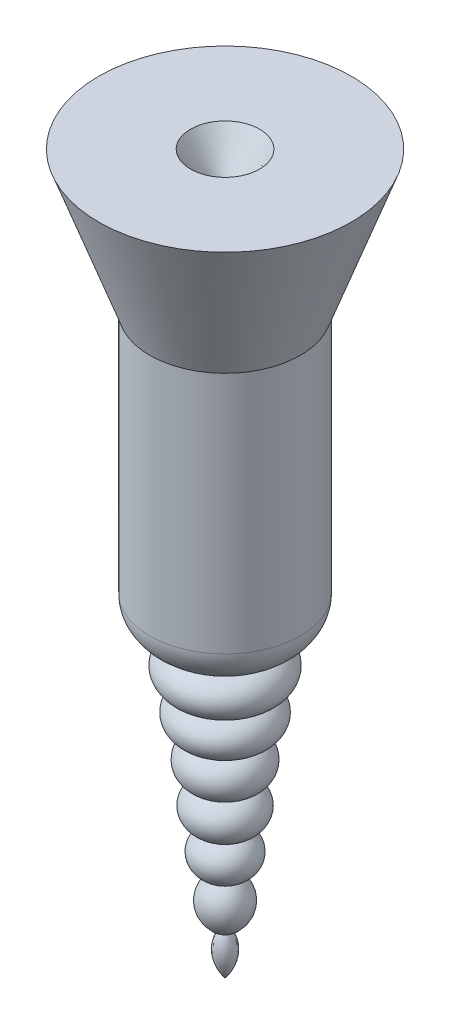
ISO-10303-21;
HEADER;
FILE_DESCRIPTION(('STEP AP214'),'2;1');
FILE_NAME('part.step','',(''),(''),'','','');
FILE_SCHEMA(('AUTOMOTIVE_DESIGN { 1 0 10303 214 1 1 1 1 }'));
ENDSEC;
DATA;
#1=APPLICATION_CONTEXT('core data for automotive mechanical design processes');
#2=APPLICATION_PROTOCOL_DEFINITION('international standard','automotive_design',2000,#1);
#3=PRODUCT_CONTEXT('',#1,'mechanical');
#4=PRODUCT('Part','Part','',(#3));
#5=PRODUCT_RELATED_PRODUCT_CATEGORY('part','',(#4));
#6=PRODUCT_DEFINITION_FORMATION('','',#4);
#7=PRODUCT_DEFINITION_CONTEXT('part definition',#1,'design');
#8=PRODUCT_DEFINITION('design','',#6,#7);
#9=PRODUCT_DEFINITION_SHAPE('','',#8);
#10=(LENGTH_UNIT() NAMED_UNIT(*) SI_UNIT(.MILLI.,.METRE.));
#11=(NAMED_UNIT(*) PLANE_ANGLE_UNIT() SI_UNIT($,.RADIAN.));
#12=(NAMED_UNIT(*) SI_UNIT($,.STERADIAN.) SOLID_ANGLE_UNIT());
#13=UNCERTAINTY_MEASURE_WITH_UNIT(LENGTH_MEASURE(1.E-05),#10,'distance_accuracy_value','');
#14=(GEOMETRIC_REPRESENTATION_CONTEXT(3) GLOBAL_UNCERTAINTY_ASSIGNED_CONTEXT((#13)) GLOBAL_UNIT_ASSIGNED_CONTEXT((#10,
#11,#12)) REPRESENTATION_CONTEXT('',''));
#15=CARTESIAN_POINT('',(0.,0.,0.));
#16=DIRECTION('',(0.,0.,1.));
#17=DIRECTION('',(1.,0.,0.));
#18=AXIS2_PLACEMENT_3D('',#15,#16,#17);
#19=CARTESIAN_POINT('',(0.387200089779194,-5.90390209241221,0.));
#20=DIRECTION('',(0.,0.,1.));
#21=DIRECTION('',(0.99999813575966,0.00193092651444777,0.));
#22=AXIS2_PLACEMENT_3D('',#19,#20,#21);
#23=ELLIPSE('',#22,0.944896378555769,0.756009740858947);
#24=TRIMMED_CURVE('',#23,(PARAMETER_VALUE(4.28863035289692)),
(PARAMETER_VALUE(8.27465039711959)),.T.,.PARAMETER.);
#25=CARTESIAN_POINT('',(0.,0.,0.));
#26=DIRECTION('',(0.,1.,0.));
#27=AXIS1_PLACEMENT('',#25,#26);
#28=SURFACE_OF_REVOLUTION('',#24,#27);
#29=CARTESIAN_POINT('',(0.,-5.90324555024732,0.));
#30=DIRECTION('',(0.,1.,0.));
#31=DIRECTION('',(-1.,0.,0.));
#32=AXIS2_PLACEMENT_3D('',#29,#30,#31);
#33=CIRCLE('',#32,1.33209583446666);
#34=CARTESIAN_POINT('',(-1.33209583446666,-5.90324555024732,0.));
#35=VERTEX_POINT('',#34);
#36=EDGE_CURVE('E11',#35,#35,#33,.T.);
#37=ORIENTED_EDGE('',*,*,#36,.F.);
#38=EDGE_LOOP('',(#37));
#39=FACE_BOUND('',#38,.T.);
#40=CARTESIAN_POINT('',(0.,-6.64767513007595,0.));
#41=DIRECTION('',(0.,1.,0.));
#42=DIRECTION('',(-1.,0.,0.));
#43=AXIS2_PLACEMENT_3D('',#40,#41,#42);
#44=CIRCLE('',#43,0.555715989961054);
#45=CARTESIAN_POINT('',(-0.555715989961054,-6.64767513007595,0.));
#46=VERTEX_POINT('',#45);
#47=EDGE_CURVE('E80',#46,#46,#44,.T.);
#48=ORIENTED_EDGE('',*,*,#47,.T.);
#49=EDGE_LOOP('',(#48));
#50=FACE_BOUND('',#49,.T.);
#51=ADVANCED_FACE('F33',(#39,#50),#28,.T.);
#52=CARTESIAN_POINT('',(0.,0.,0.));
#53=DIRECTION('',(0.,1.,0.));
#54=DIRECTION('',(-1.,0.,0.));
#55=AXIS2_PLACEMENT_3D('',#52,#53,#54);
#56=CYLINDRICAL_SURFACE('',#55,1.33209583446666);
#57=CARTESIAN_POINT('',(0.,-1.60252965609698,0.));
#58=DIRECTION('',(0.,1.,0.));
#59=DIRECTION('',(-1.,0.,0.));
#60=AXIS2_PLACEMENT_3D('',#57,#58,#59);
#61=CIRCLE('',#60,1.33209583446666);
#62=CARTESIAN_POINT('',(-1.33209583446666,-1.60252965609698,0.));
#63=VERTEX_POINT('',#62);
#64=EDGE_CURVE('E41',#63,#63,#61,.T.);
#65=ORIENTED_EDGE('',*,*,#64,.F.);
#66=EDGE_LOOP('',(#65));
#67=FACE_BOUND('',#66,.T.);
#68=ORIENTED_EDGE('',*,*,#36,.T.);
#69=EDGE_LOOP('',(#68));
#70=FACE_BOUND('',#69,.T.);
#71=ADVANCED_FACE('F71',(#67,#70),#56,.T.);
#72=CARTESIAN_POINT('',(0.,-1.60252965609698,0.));
#73=DIRECTION('',(0.,1.,0.));
#74=DIRECTION('',(-1.,0.,0.));
#75=AXIS2_PLACEMENT_3D('',#72,#73,#74);
#76=CONICAL_SURFACE('',#75,1.33209583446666,0.347530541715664);
#77=CARTESIAN_POINT('',(0.,0.890631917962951,0.));
#78=DIRECTION('',(0.,1.,0.));
#79=DIRECTION('',(-1.,0.,0.));
#80=AXIS2_PLACEMENT_3D('',#77,#78,#79);
#81=CIRCLE('',#80,2.2352);
#82=CARTESIAN_POINT('',(-2.2352,0.890631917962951,0.));
#83=VERTEX_POINT('',#82);
#84=EDGE_CURVE('E57',#83,#83,#81,.T.);
#85=ORIENTED_EDGE('',*,*,#84,.F.);
#86=EDGE_LOOP('',(#85));
#87=FACE_BOUND('',#86,.T.);
#88=ORIENTED_EDGE('',*,*,#64,.T.);
#89=EDGE_LOOP('',(#88));
#90=FACE_BOUND('',#89,.T.);
#91=ADVANCED_FACE('F69',(#87,#90),#76,.T.);
#92=CARTESIAN_POINT('',(0.611730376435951,0.890631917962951,0.));
#93=DIRECTION('',(0.,-1.,0.));
#94=DIRECTION('',(1.,0.,0.));
#95=AXIS2_PLACEMENT_3D('',#92,#93,#94);
#96=PLANE('',#95);
#97=CARTESIAN_POINT('',(0.,0.890631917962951,0.));
#98=DIRECTION('',(0.,1.,0.));
#99=DIRECTION('',(-1.,0.,0.));
#100=AXIS2_PLACEMENT_3D('',#97,#98,#99);
#101=CIRCLE('',#100,0.611730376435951);
#102=CARTESIAN_POINT('',(-0.611730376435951,0.890631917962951,0.));
#103=VERTEX_POINT('',#102);
#104=EDGE_CURVE('E55',#103,#103,#101,.T.);
#105=ORIENTED_EDGE('',*,*,#104,.F.);
#106=EDGE_LOOP('',(#105));
#107=FACE_BOUND('',#106,.T.);
#108=ORIENTED_EDGE('',*,*,#84,.T.);
#109=EDGE_LOOP('',(#108));
#110=FACE_BOUND('',#109,.T.);
#111=ADVANCED_FACE('F51',(#107,#110),#96,.F.);
#112=CARTESIAN_POINT('',(0.,0.890631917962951,0.));
#113=DIRECTION('',(0.,1.,0.));
#114=DIRECTION('',(-1.,0.,0.));
#115=AXIS2_PLACEMENT_3D('',#112,#113,#114);
#116=CONICAL_SURFACE('',#115,0.611730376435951,0.601845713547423);
#117=CARTESIAN_POINT('',(0.,0.,0.));
#118=VERTEX_POINT('',#117);
#119=VERTEX_LOOP('',#118);
#120=FACE_BOUND('',#119,.T.);
#121=ORIENTED_EDGE('',*,*,#104,.T.);
#122=EDGE_LOOP('',(#121));
#123=FACE_BOUND('',#122,.T.);
#124=ADVANCED_FACE('F47',(#120,#123),#116,.F.);
#125=CARTESIAN_POINT('',(-2.03948248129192,-11.4936827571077,0.));
#126=DIRECTION('',(0.,0.,1.));
#127=DIRECTION('',(0.997056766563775,0.0766668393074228,0.));
#128=AXIS2_PLACEMENT_3D('',#125,#126,#127);
#129=ELLIPSE('',#128,2.21584956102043,1.11741103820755);
#130=TRIMMED_CURVE('',#129,(PARAMETER_VALUE(5.84796007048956)),
(PARAMETER_VALUE(6.640897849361)),.T.,.PARAMETER.);
#131=CARTESIAN_POINT('',(0.,0.,0.));
#132=DIRECTION('',(0.,1.,0.));
#133=AXIS1_PLACEMENT('',#131,#132);
#134=SURFACE_OF_REVOLUTION('',#130,#133);
#135=CARTESIAN_POINT('',(0.,-11.0787103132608,0.));
#136=DIRECTION('',(0.,1.,0.));
#137=DIRECTION('',(-1.,0.,0.));
#138=AXIS2_PLACEMENT_3D('',#135,#136,#137);
#139=CIRCLE('',#138,0.0946009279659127);
#140=CARTESIAN_POINT('',(-0.094600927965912,-11.0787103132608,0.));
#141=VERTEX_POINT('',#140);
#142=EDGE_CURVE('E58',#141,#141,#139,.T.);
#143=ORIENTED_EDGE('',*,*,#142,.F.);
#144=EDGE_LOOP('',(#143));
#145=FACE_BOUND('',#144,.T.);
#146=CARTESIAN_POINT('',(0.,-11.809368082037,0.));
#147=VERTEX_POINT('',#146);
#148=VERTEX_LOOP('',#147);
#149=FACE_BOUND('',#148,.T.);
#150=ADVANCED_FACE('F50',(#145,#149),#134,.T.);
#151=CARTESIAN_POINT('',(-0.296065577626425,-10.6194950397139,0.));
#152=DIRECTION('',(0.,0.,1.));
#153=DIRECTION('',(0.999999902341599,-0.000441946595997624,0.));
#154=AXIS2_PLACEMENT_3D('',#151,#152,#153);
#155=ELLIPSE('',#154,0.692217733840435,0.556198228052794);
#156=TRIMMED_CURVE('',#155,(PARAMETER_VALUE(5.15469734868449)),
(PARAMETER_VALUE(7.412383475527)),.T.,.PARAMETER.);
#157=CARTESIAN_POINT('',(0.,0.,0.));
#158=DIRECTION('',(0.,1.,0.));
#159=AXIS1_PLACEMENT('',#157,#158);
#160=SURFACE_OF_REVOLUTION('',#156,#159);
#161=CARTESIAN_POINT('',(0.,-10.2336673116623,0.));
#162=DIRECTION('',(0.,1.,0.));
#163=DIRECTION('',(-1.,0.,0.));
#164=AXIS2_PLACEMENT_3D('',#161,#162,#163);
#165=CIRCLE('',#164,0.20242874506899);
#166=CARTESIAN_POINT('',(-0.20242874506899,-10.2336673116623,0.));
#167=VERTEX_POINT('',#166);
#168=EDGE_CURVE('E63',#167,#167,#165,.T.);
#169=ORIENTED_EDGE('',*,*,#168,.F.);
#170=EDGE_LOOP('',(#169));
#171=FACE_BOUND('',#170,.T.);
#172=ORIENTED_EDGE('',*,*,#142,.T.);
#173=EDGE_LOOP('',(#172));
#174=FACE_BOUND('',#173,.T.);
#175=ADVANCED_FACE('F103',(#171,#174),#160,.T.);
#176=CARTESIAN_POINT('',(0.023317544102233,-9.8712656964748,0.));
#177=DIRECTION('',(0.,0.,1.));
#178=DIRECTION('',(-0.999999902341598,0.000441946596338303,0.));
#179=AXIS2_PLACEMENT_3D('',#176,#177,#178);
#180=ELLIPSE('',#179,0.478569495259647,0.390775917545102);
#181=TRIMMED_CURVE('',#180,(PARAMETER_VALUE(1.52241447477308)),
(PARAMETER_VALUE(4.76149257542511)),.T.,.PARAMETER.);
#182=CARTESIAN_POINT('',(0.,0.,0.));
#183=DIRECTION('',(0.,1.,0.));
#184=AXIS1_PLACEMENT('',#182,#183);
#185=SURFACE_OF_REVOLUTION('',#181,#184);
#186=CARTESIAN_POINT('',(0.,-9.5302389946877,0.));
#187=DIRECTION('',(0.,1.,0.));
#188=DIRECTION('',(-1.,0.,0.));
#189=AXIS2_PLACEMENT_3D('',#186,#187,#188);
#190=CIRCLE('',#189,0.25691458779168);
#191=CARTESIAN_POINT('',(-0.25691458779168,-9.5302389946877,0.));
#192=VERTEX_POINT('',#191);
#193=EDGE_CURVE('E96',#192,#192,#190,.T.);
#194=ORIENTED_EDGE('',*,*,#193,.F.);
#195=EDGE_LOOP('',(#194));
#196=FACE_BOUND('',#195,.T.);
#197=ORIENTED_EDGE('',*,*,#168,.T.);
#198=EDGE_LOOP('',(#197));
#199=FACE_BOUND('',#198,.T.);
#200=ADVANCED_FACE('F101',(#196,#199),#185,.T.);
#201=CARTESIAN_POINT('',(0.157713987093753,-9.16454014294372,0.));
#202=DIRECTION('',(0.,0.,1.));
#203=DIRECTION('',(-0.999999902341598,0.00044194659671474,0.));
#204=AXIS2_PLACEMENT_3D('',#201,#202,#203);
#205=ELLIPSE('',#204,0.445960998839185,0.375083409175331);
#206=TRIMMED_CURVE('',#205,(PARAMETER_VALUE(1.20969790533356)),
(PARAMETER_VALUE(5.0742308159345)),.T.,.PARAMETER.);
#207=CARTESIAN_POINT('',(0.,0.,0.));
#208=DIRECTION('',(0.,1.,0.));
#209=AXIS1_PLACEMENT('',#207,#208);
#210=SURFACE_OF_REVOLUTION('',#206,#209);
#211=CARTESIAN_POINT('',(0.,-8.822028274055,0.));
#212=DIRECTION('',(0.,1.,0.));
#213=DIRECTION('',(-1.,0.,0.));
#214=AXIS2_PLACEMENT_3D('',#211,#212,#213);
#215=CIRCLE('',#214,0.339423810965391);
#216=CARTESIAN_POINT('',(-0.339423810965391,-8.822028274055,0.));
#217=VERTEX_POINT('',#216);
#218=EDGE_CURVE('E93',#217,#217,#215,.T.);
#219=ORIENTED_EDGE('',*,*,#218,.F.);
#220=EDGE_LOOP('',(#219));
#221=FACE_BOUND('',#220,.T.);
#222=ORIENTED_EDGE('',*,*,#193,.T.);
#223=EDGE_LOOP('',(#222));
#224=FACE_BOUND('',#223,.T.);
#225=ADVANCED_FACE('F127',(#221,#224),#210,.T.);
#226=CARTESIAN_POINT('',(0.274292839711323,-8.45972559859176,0.));
#227=DIRECTION('',(0.,0.,1.));
#228=DIRECTION('',(-0.999999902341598,0.000441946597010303,0.));
#229=AXIS2_PLACEMENT_3D('',#226,#227,#228);
#230=ELLIPSE('',#229,0.401365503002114,0.36716443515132);
#231=TRIMMED_CURVE('',#230,(PARAMETER_VALUE(0.818791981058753)),
(PARAMETER_VALUE(5.46520190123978)),.T.,.PARAMETER.);
#232=CARTESIAN_POINT('',(0.,0.,0.));
#233=DIRECTION('',(0.,1.,0.));
#234=AXIS1_PLACEMENT('',#232,#233);
#235=SURFACE_OF_REVOLUTION('',#231,#234);
#236=CARTESIAN_POINT('',(0.,-8.10137983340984,0.));
#237=DIRECTION('',(0.,1.,0.));
#238=DIRECTION('',(-1.,0.,0.));
#239=AXIS2_PLACEMENT_3D('',#236,#237,#238);
#240=CIRCLE('',#239,0.361700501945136);
#241=CARTESIAN_POINT('',(-0.361700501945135,-8.10137983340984,0.));
#242=VERTEX_POINT('',#241);
#243=EDGE_CURVE('E85',#242,#242,#240,.T.);
#244=ORIENTED_EDGE('',*,*,#243,.F.);
#245=EDGE_LOOP('',(#244));
#246=FACE_BOUND('',#245,.T.);
#247=ORIENTED_EDGE('',*,*,#218,.T.);
#248=EDGE_LOOP('',(#247));
#249=FACE_BOUND('',#248,.T.);
#250=ADVANCED_FACE('F131',(#246,#249),#235,.T.);
#251=CARTESIAN_POINT('',(0.362270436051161,-7.73721934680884,0.));
#252=DIRECTION('',(0.,0.,1.));
#253=DIRECTION('',(0.9999999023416,-0.000441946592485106,0.));
#254=AXIS2_PLACEMENT_3D('',#251,#252,#253);
#255=ELLIPSE('',#254,0.4552010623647,0.364160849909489);
#256=TRIMMED_CURVE('',#255,(PARAMETER_VALUE(3.7923372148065)),
(PARAMETER_VALUE(8.77474051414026)),.T.,.PARAMETER.);
#257=CARTESIAN_POINT('',(0.,0.,0.));
#258=DIRECTION('',(0.,1.,0.));
#259=AXIS1_PLACEMENT('',#257,#258);
#260=SURFACE_OF_REVOLUTION('',#256,#259);
#261=CARTESIAN_POINT('',(0.,-7.39196406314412,0.));
#262=DIRECTION('',(0.,1.,0.));
#263=DIRECTION('',(-1.,0.,0.));
#264=AXIS2_PLACEMENT_3D('',#261,#262,#263);
#265=CIRCLE('',#264,0.506946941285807);
#266=CARTESIAN_POINT('',(-0.506946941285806,-7.39196406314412,0.));
#267=VERTEX_POINT('',#266);
#268=EDGE_CURVE('E82',#267,#267,#265,.T.);
#269=ORIENTED_EDGE('',*,*,#268,.F.);
#270=EDGE_LOOP('',(#269));
#271=FACE_BOUND('',#270,.T.);
#272=ORIENTED_EDGE('',*,*,#243,.T.);
#273=EDGE_LOOP('',(#272));
#274=FACE_BOUND('',#273,.T.);
#275=ADVANCED_FACE('F135',(#271,#274),#260,.T.);
#276=CARTESIAN_POINT('',(0.484721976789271,-7.01785760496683,0.));
#277=DIRECTION('',(0.,0.,1.));
#278=DIRECTION('',(-0.999999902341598,0.000441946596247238,0.));
#279=AXIS2_PLACEMENT_3D('',#276,#277,#278);
#280=ELLIPSE('',#279,0.468156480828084,0.374525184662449);
#281=CARTESIAN_POINT('',(0.,0.,0.));
#282=DIRECTION('',(0.,1.,0.));
#283=AXIS1_PLACEMENT('',#281,#282);
#284=SURFACE_OF_REVOLUTION('',#280,#283);
#285=ORIENTED_EDGE('',*,*,#47,.F.);
#286=EDGE_LOOP('',(#285));
#287=FACE_BOUND('',#286,.T.);
#288=ORIENTED_EDGE('',*,*,#268,.T.);
#289=EDGE_LOOP('',(#288));
#290=FACE_BOUND('',#289,.T.);
#291=ADVANCED_FACE('F141',(#287,#290),#284,.T.);
#292=CLOSED_SHELL('',(#51,#71,#91,#111,#124,#150,#175,#200,#225,#250,#275,#291));
#293=MANIFOLD_SOLID_BREP('B2',#292);
#294=ADVANCED_BREP_SHAPE_REPRESENTATION('',(#18,#293),#14);
#295=SHAPE_DEFINITION_REPRESENTATION(#9,#294);
ENDSEC;
END-ISO-10303-21;
